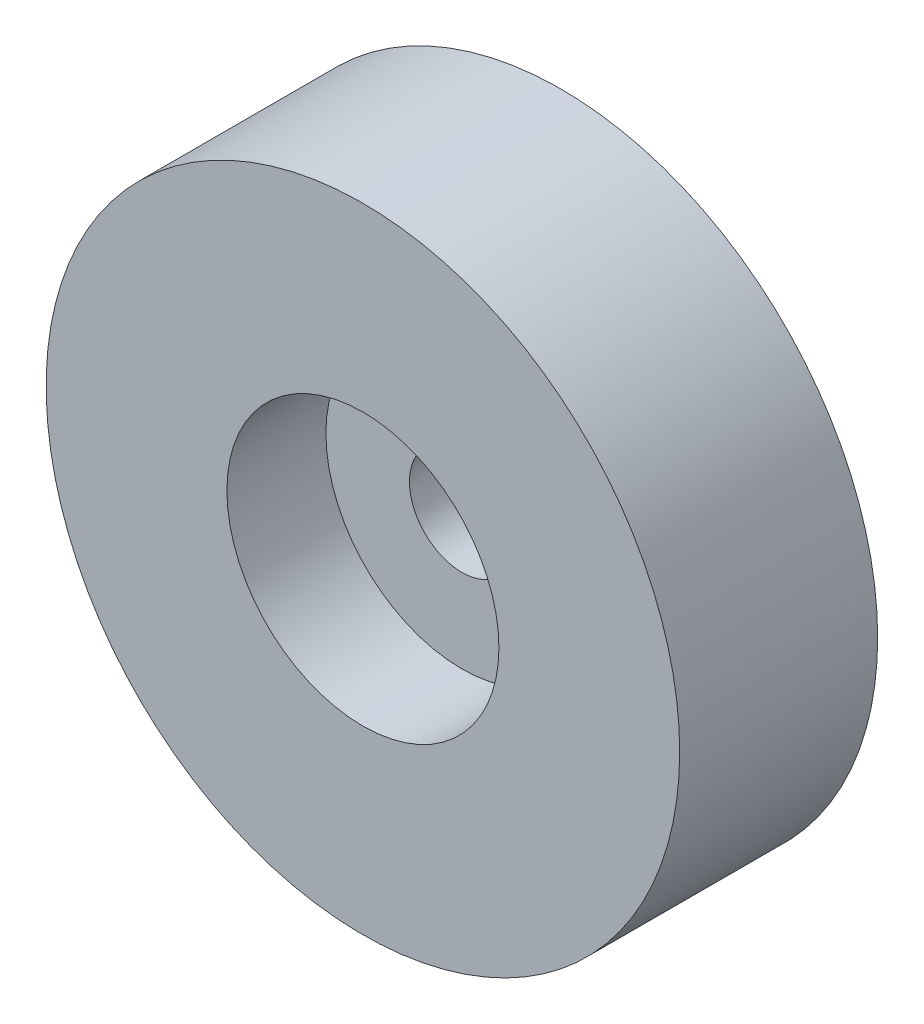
from build123d import *

# Parameters (mm, degrees)
SKETCH1_R           = 20.32
BASE_EXTRUDE_DEPTH  = 12.7
SKETCH2_R           = 8.7249
CUT_EXTRUDE1_DEPTH  = 6.35
SKETCH3_R           = 3.3655
CUT_EXTRUDE2_DEPTH  = 30.430040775
SKETCH4_R           = 8.509
SKETCH4_R_2         = 3.3655
BOSS_EXTRUDE1_DEPTH = 7.62


with BuildPart() as part:
    # Sketch1 → Base-Extrude (new body)
    with BuildSketch(Plane.XY):
        Circle(SKETCH1_R)
    extrude(amount=BASE_EXTRUDE_DEPTH)

    # Sketch2 → Cut-Extrude1 (cut)
    with BuildSketch(Plane.XY.offset(12.7)):
        Circle(SKETCH2_R)
    extrude(amount=-CUT_EXTRUDE1_DEPTH, mode=Mode.SUBTRACT)

    # Sketch3 → Cut-Extrude2 (cut, through all)
    with BuildSketch(Plane.XY.offset(6.35)):
        Circle(SKETCH3_R)
    extrude(amount=-CUT_EXTRUDE2_DEPTH, mode=Mode.SUBTRACT)

    # Sketch4 → Boss-Extrude1 (add)
    with BuildSketch(Plane(origin=(0, 0, 0), x_dir=(-1, 0, 0), z_dir=(0, 0, -1))):
        with Locations(Location((0, 0, 0), (0, 0, 180))):
            Circle(SKETCH4_R)
        with Locations(Location((0, 0, 0), (0, 0, 180))):
            Circle(SKETCH4_R_2, mode=Mode.SUBTRACT)
    extrude(amount=BOSS_EXTRUDE1_DEPTH)


solid = part.part
